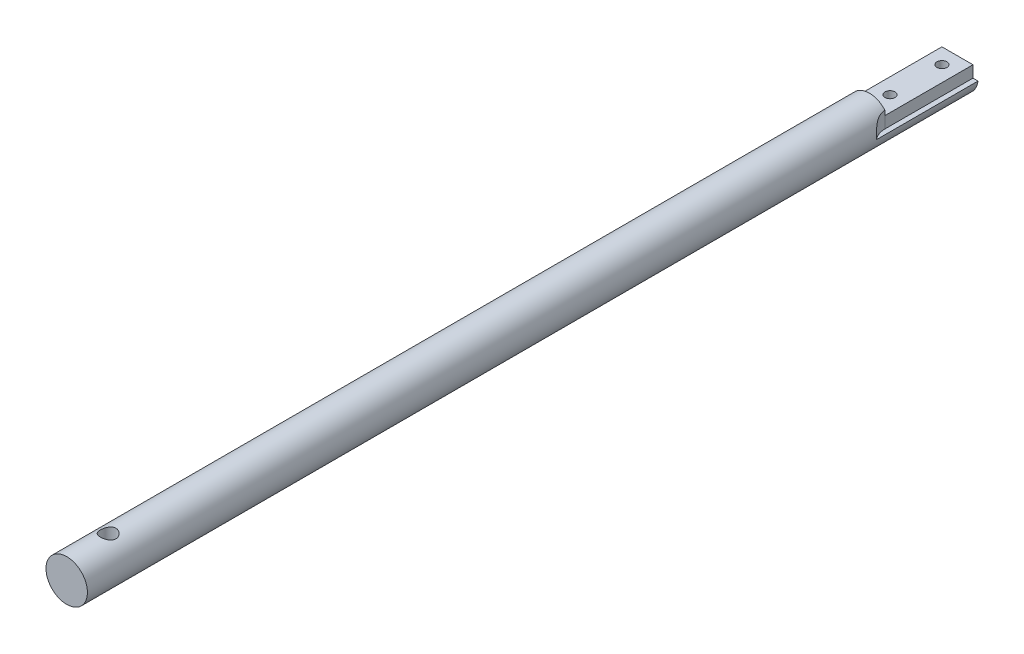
ISO-10303-21;
HEADER;
FILE_DESCRIPTION(('STEP AP214'),'2;1');
FILE_NAME('part.step','',(''),(''),'','','');
FILE_SCHEMA(('AUTOMOTIVE_DESIGN { 1 0 10303 214 1 1 1 1 }'));
ENDSEC;
DATA;
#1=APPLICATION_CONTEXT('core data for automotive mechanical design processes');
#2=APPLICATION_PROTOCOL_DEFINITION('international standard','automotive_design',2000,#1);
#3=PRODUCT_CONTEXT('',#1,'mechanical');
#4=PRODUCT('Part','Part','',(#3));
#5=PRODUCT_RELATED_PRODUCT_CATEGORY('part','',(#4));
#6=PRODUCT_DEFINITION_FORMATION('','',#4);
#7=PRODUCT_DEFINITION_CONTEXT('part definition',#1,'design');
#8=PRODUCT_DEFINITION('design','',#6,#7);
#9=PRODUCT_DEFINITION_SHAPE('','',#8);
#10=(LENGTH_UNIT() NAMED_UNIT(*) SI_UNIT(.MILLI.,.METRE.));
#11=(NAMED_UNIT(*) PLANE_ANGLE_UNIT() SI_UNIT($,.RADIAN.));
#12=(NAMED_UNIT(*) SI_UNIT($,.STERADIAN.) SOLID_ANGLE_UNIT());
#13=UNCERTAINTY_MEASURE_WITH_UNIT(LENGTH_MEASURE(1.E-05),#10,'distance_accuracy_value','');
#14=(GEOMETRIC_REPRESENTATION_CONTEXT(3) GLOBAL_UNCERTAINTY_ASSIGNED_CONTEXT((#13)) GLOBAL_UNIT_ASSIGNED_CONTEXT((#10,
#11,#12)) REPRESENTATION_CONTEXT('',''));
#15=CARTESIAN_POINT('',(0.,0.,0.));
#16=DIRECTION('',(0.,0.,1.));
#17=DIRECTION('',(1.,0.,0.));
#18=AXIS2_PLACEMENT_3D('',#15,#16,#17);
#19=CARTESIAN_POINT('',(0.,0.,136.525));
#20=DIRECTION('',(0.,0.,-1.));
#21=DIRECTION('',(-1.,0.,0.));
#22=AXIS2_PLACEMENT_3D('',#19,#20,#21);
#23=CYLINDRICAL_SURFACE('',#22,3.17500000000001);
#24=CARTESIAN_POINT('',(0.,3.17500000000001,128.98755));
#25=CARTESIAN_POINT('',(-0.0643205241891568,3.17500167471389,128.987547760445));
#26=CARTESIAN_POINT('',(-0.128625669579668,3.173028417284,128.992792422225));
#27=CARTESIAN_POINT('',(-0.255314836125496,3.16535384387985,129.013548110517));
#28=CARTESIAN_POINT('',(-0.317699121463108,3.15965304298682,129.029057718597));
#29=CARTESIAN_POINT('',(-0.43870123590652,3.14513549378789,129.069718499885));
#30=CARTESIAN_POINT('',(-0.497326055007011,3.13632473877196,129.094851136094));
#31=CARTESIAN_POINT('',(-0.609523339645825,3.11646539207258,129.153950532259));
#32=CARTESIAN_POINT('',(-0.663094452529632,3.10541620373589,129.18791964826));
#33=CARTESIAN_POINT('',(-0.765928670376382,3.08169919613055,129.265228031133));
#34=CARTESIAN_POINT('',(-0.814949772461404,3.06898573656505,129.30887507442));
#35=CARTESIAN_POINT('',(-0.905171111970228,3.04359834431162,129.403646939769));
#36=CARTESIAN_POINT('',(-0.946368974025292,3.03092442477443,129.454774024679));
#37=CARTESIAN_POINT('',(-1.02130925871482,3.00652079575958,129.565414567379));
#38=CARTESIAN_POINT('',(-1.05471050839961,2.99484497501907,129.625172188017));
#39=CARTESIAN_POINT('',(-1.11088113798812,2.9744692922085,129.749962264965));
#40=CARTESIAN_POINT('',(-1.13365473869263,2.96576824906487,129.814992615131));
#41=CARTESIAN_POINT('',(-1.16696942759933,2.95281508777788,129.945697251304));
#42=CARTESIAN_POINT('',(-1.17797216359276,2.94839576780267,130.011236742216));
#43=CARTESIAN_POINT('',(-1.18887621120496,2.94401704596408,130.143369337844));
#44=CARTESIAN_POINT('',(-1.18878207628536,2.94405581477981,130.209961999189));
#45=CARTESIAN_POINT('',(-1.17784820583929,2.94844466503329,130.338093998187));
#46=CARTESIAN_POINT('',(-1.16764792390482,2.95253818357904,130.399698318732));
#47=CARTESIAN_POINT('',(-1.13784807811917,2.96414908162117,130.520247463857));
#48=CARTESIAN_POINT('',(-1.11824710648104,2.97166697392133,130.579191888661));
#49=CARTESIAN_POINT('',(-1.06984946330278,2.98943472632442,130.694055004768));
#50=CARTESIAN_POINT('',(-1.04088636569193,2.99973342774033,130.74989568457));
#51=CARTESIAN_POINT('',(-0.974702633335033,3.0218860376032,130.856110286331));
#52=CARTESIAN_POINT('',(-0.937479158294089,3.03374048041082,130.906482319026));
#53=CARTESIAN_POINT('',(-0.852902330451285,3.05863522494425,131.003870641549));
#54=CARTESIAN_POINT('',(-0.805038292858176,3.07170183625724,131.050437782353));
#55=CARTESIAN_POINT('',(-0.702029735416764,3.09686736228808,131.135017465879));
#56=CARTESIAN_POINT('',(-0.646884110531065,3.10896612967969,131.173028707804));
#57=CARTESIAN_POINT('',(-0.529736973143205,3.13107100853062,131.239909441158));
#58=CARTESIAN_POINT('',(-0.467643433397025,3.14104225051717,131.268630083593));
#59=CARTESIAN_POINT('',(-0.339040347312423,3.15751006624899,131.315068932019));
#60=CARTESIAN_POINT('',(-0.272532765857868,3.16400817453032,131.332791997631));
#61=CARTESIAN_POINT('',(-0.140770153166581,3.17252821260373,131.355870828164));
#62=CARTESIAN_POINT('',(-0.0756351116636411,3.17476883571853,131.36183147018));
#63=CARTESIAN_POINT('',(0.0547354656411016,3.1751967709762,131.362976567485));
#64=CARTESIAN_POINT('',(0.119970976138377,3.17338497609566,131.358163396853));
#65=CARTESIAN_POINT('',(0.246081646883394,3.16605593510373,131.338357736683));
#66=CARTESIAN_POINT('',(0.307028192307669,3.16068279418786,131.323760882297));
#67=CARTESIAN_POINT('',(0.425564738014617,3.14691640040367,131.285322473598));
#68=CARTESIAN_POINT('',(0.483154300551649,3.13852275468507,131.261479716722));
#69=CARTESIAN_POINT('',(0.595234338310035,3.11923888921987,131.20446718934));
#70=CARTESIAN_POINT('',(0.649584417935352,3.10828267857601,131.171044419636));
#71=CARTESIAN_POINT('',(0.752086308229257,3.08508628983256,131.09610690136));
#72=CARTESIAN_POINT('',(0.800235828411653,3.0728456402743,131.05458917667));
#73=CARTESIAN_POINT('',(0.891875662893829,3.04755189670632,130.961820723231));
#74=CARTESIAN_POINT('',(0.934936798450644,3.03449267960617,130.910146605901));
#75=CARTESIAN_POINT('',(1.01186048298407,3.00971780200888,130.800048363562));
#76=CARTESIAN_POINT('',(1.04572222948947,2.99800225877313,130.741623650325));
#77=CARTESIAN_POINT('',(1.10331435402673,2.97729202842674,130.61921353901));
#78=CARTESIAN_POINT('',(1.12700411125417,2.9683082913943,130.555207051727));
#79=CARTESIAN_POINT('',(1.16311510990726,2.95434769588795,130.423684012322));
#80=CARTESIAN_POINT('',(1.17554327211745,2.94936837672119,130.356169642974));
#81=CARTESIAN_POINT('',(1.18816166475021,2.94430614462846,130.224194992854));
#82=CARTESIAN_POINT('',(1.18908323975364,2.94393064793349,130.159815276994));
#83=CARTESIAN_POINT('',(1.1805341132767,2.94736917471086,130.031869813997));
#84=CARTESIAN_POINT('',(1.17106438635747,2.95118280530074,129.968303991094));
#85=CARTESIAN_POINT('',(1.14256968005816,2.9623269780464,129.845738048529));
#86=CARTESIAN_POINT('',(1.1238418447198,2.96954785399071,129.786658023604));
#87=CARTESIAN_POINT('',(1.07762368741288,2.98662957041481,129.672443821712));
#88=CARTESIAN_POINT('',(1.05013115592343,2.99649107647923,129.617310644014));
#89=CARTESIAN_POINT('',(0.985497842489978,3.01838358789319,129.509425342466));
#90=CARTESIAN_POINT('',(0.94792821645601,3.03050098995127,129.456947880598));
#91=CARTESIAN_POINT('',(0.864872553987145,3.05524081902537,129.358808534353));
#92=CARTESIAN_POINT('',(0.819384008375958,3.06786340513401,129.313148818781));
#93=CARTESIAN_POINT('',(0.718861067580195,3.09300575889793,129.227441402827));
#94=CARTESIAN_POINT('',(0.663445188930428,3.10548359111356,129.187826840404));
#95=CARTESIAN_POINT('',(0.546305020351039,3.12821550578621,129.118486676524));
#96=CARTESIAN_POINT('',(0.484580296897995,3.13846943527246,129.088761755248));
#97=CARTESIAN_POINT('',(0.35386066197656,3.1559346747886,129.039262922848));
#98=CARTESIAN_POINT('',(0.284671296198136,3.16300376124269,129.019947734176));
#99=CARTESIAN_POINT('',(0.143647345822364,3.17253434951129,128.994095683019));
#100=CARTESIAN_POINT('',(0.0718140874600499,3.17499813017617,128.987552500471));
#101=CARTESIAN_POINT('',(0.,3.17500000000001,128.98755));
#102=B_SPLINE_CURVE_WITH_KNOTS('',3,(#24,#25,#26,#27,#28,#29,#30,#31,#32,#33,#34,#35,#36,#37,
#38,#39,#40,#41,#42,#43,#44,#45,#46,#47,#48,#49,#50,#51,#52,#53,#54,#55,#56,#57,#58,#59,#60,#61,
#62,#63,#64,#65,#66,#67,#68,#69,#70,#71,#72,#73,#74,#75,#76,#77,#78,#79,#80,#81,#82,#83,#84,#85,
#86,#87,#88,#89,#90,#91,#92,#93,#94,#95,#96,#97,#98,#99,#100,#101),.UNSPECIFIED.,.T.,.F.,(4,2,2,
2,2,2,2,2,2,2,2,2,2,2,2,2,2,2,2,2,2,2,2,2,2,2,2,2,2,2,2,2,2,2,2,2,2,2,4),(0.,0.192696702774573,
0.385366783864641,0.577667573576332,0.770019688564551,0.969702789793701,1.1694464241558,
1.37674966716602,1.58397050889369,1.78272732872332,1.98140259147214,2.16826116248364,
2.35514772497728,2.54555824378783,2.73603433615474,2.93923825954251,3.1424730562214,
3.3488189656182,3.5550736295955,3.75041263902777,3.94570860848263,4.13354868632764,
4.32141320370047,4.51478656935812,4.70823116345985,4.91283824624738,5.1174631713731,
5.32289781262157,5.52820611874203,5.72039353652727,5.9125629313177,6.09892997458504,
6.28534403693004,6.48149216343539,6.67770255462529,6.88445138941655,7.0912144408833,
7.306467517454,7.52161405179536),.UNSPECIFIED.);
#103=CARTESIAN_POINT('',(0.,3.17500000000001,128.98755));
#104=VERTEX_POINT('',#103);
#105=EDGE_CURVE('E11',#104,#104,#102,.T.);
#106=ORIENTED_EDGE('',*,*,#105,.F.);
#107=EDGE_LOOP('',(#106));
#108=FACE_BOUND('',#107,.T.);
#109=CARTESIAN_POINT('',(0.,-3.17500000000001,128.98755));
#110=CARTESIAN_POINT('',(0.0643205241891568,-3.17500167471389,128.987547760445));
#111=CARTESIAN_POINT('',(0.128625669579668,-3.173028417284,128.992792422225));
#112=CARTESIAN_POINT('',(0.255314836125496,-3.16535384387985,129.013548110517));
#113=CARTESIAN_POINT('',(0.317699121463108,-3.15965304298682,129.029057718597));
#114=CARTESIAN_POINT('',(0.43870123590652,-3.14513549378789,129.069718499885));
#115=CARTESIAN_POINT('',(0.497326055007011,-3.13632473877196,129.094851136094));
#116=CARTESIAN_POINT('',(0.609523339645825,-3.11646539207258,129.153950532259));
#117=CARTESIAN_POINT('',(0.663094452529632,-3.10541620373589,129.18791964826));
#118=CARTESIAN_POINT('',(0.765928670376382,-3.08169919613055,129.265228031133));
#119=CARTESIAN_POINT('',(0.814949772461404,-3.06898573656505,129.30887507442));
#120=CARTESIAN_POINT('',(0.905171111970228,-3.04359834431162,129.403646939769));
#121=CARTESIAN_POINT('',(0.946368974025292,-3.03092442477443,129.454774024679));
#122=CARTESIAN_POINT('',(1.02130925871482,-3.00652079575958,129.565414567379));
#123=CARTESIAN_POINT('',(1.05471050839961,-2.99484497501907,129.625172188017));
#124=CARTESIAN_POINT('',(1.11088113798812,-2.9744692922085,129.749962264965));
#125=CARTESIAN_POINT('',(1.13365473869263,-2.96576824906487,129.814992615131));
#126=CARTESIAN_POINT('',(1.16696942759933,-2.95281508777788,129.945697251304));
#127=CARTESIAN_POINT('',(1.17797216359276,-2.94839576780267,130.011236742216));
#128=CARTESIAN_POINT('',(1.18887621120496,-2.94401704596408,130.143369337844));
#129=CARTESIAN_POINT('',(1.18878207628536,-2.94405581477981,130.209961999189));
#130=CARTESIAN_POINT('',(1.17784820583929,-2.94844466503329,130.338093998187));
#131=CARTESIAN_POINT('',(1.16764792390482,-2.95253818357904,130.399698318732));
#132=CARTESIAN_POINT('',(1.13784807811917,-2.96414908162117,130.520247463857));
#133=CARTESIAN_POINT('',(1.11824710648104,-2.97166697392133,130.579191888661));
#134=CARTESIAN_POINT('',(1.06984946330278,-2.98943472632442,130.694055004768));
#135=CARTESIAN_POINT('',(1.04088636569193,-2.99973342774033,130.74989568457));
#136=CARTESIAN_POINT('',(0.974702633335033,-3.0218860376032,130.856110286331));
#137=CARTESIAN_POINT('',(0.937479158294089,-3.03374048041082,130.906482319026));
#138=CARTESIAN_POINT('',(0.852902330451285,-3.05863522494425,131.003870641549));
#139=CARTESIAN_POINT('',(0.805038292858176,-3.07170183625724,131.050437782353));
#140=CARTESIAN_POINT('',(0.702029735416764,-3.09686736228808,131.135017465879));
#141=CARTESIAN_POINT('',(0.646884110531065,-3.10896612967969,131.173028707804));
#142=CARTESIAN_POINT('',(0.529736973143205,-3.13107100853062,131.239909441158));
#143=CARTESIAN_POINT('',(0.467643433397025,-3.14104225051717,131.268630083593));
#144=CARTESIAN_POINT('',(0.339040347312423,-3.15751006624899,131.315068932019));
#145=CARTESIAN_POINT('',(0.272532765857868,-3.16400817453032,131.332791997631));
#146=CARTESIAN_POINT('',(0.140770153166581,-3.17252821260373,131.355870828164));
#147=CARTESIAN_POINT('',(0.0756351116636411,-3.17476883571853,131.36183147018));
#148=CARTESIAN_POINT('',(-0.0547354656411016,-3.1751967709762,131.362976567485));
#149=CARTESIAN_POINT('',(-0.119970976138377,-3.17338497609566,131.358163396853));
#150=CARTESIAN_POINT('',(-0.246081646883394,-3.16605593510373,131.338357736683));
#151=CARTESIAN_POINT('',(-0.307028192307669,-3.16068279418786,131.323760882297));
#152=CARTESIAN_POINT('',(-0.425564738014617,-3.14691640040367,131.285322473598));
#153=CARTESIAN_POINT('',(-0.483154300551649,-3.13852275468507,131.261479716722));
#154=CARTESIAN_POINT('',(-0.595234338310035,-3.11923888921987,131.20446718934));
#155=CARTESIAN_POINT('',(-0.649584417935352,-3.10828267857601,131.171044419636));
#156=CARTESIAN_POINT('',(-0.752086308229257,-3.08508628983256,131.09610690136));
#157=CARTESIAN_POINT('',(-0.800235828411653,-3.0728456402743,131.05458917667));
#158=CARTESIAN_POINT('',(-0.891875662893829,-3.04755189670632,130.961820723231));
#159=CARTESIAN_POINT('',(-0.934936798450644,-3.03449267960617,130.910146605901));
#160=CARTESIAN_POINT('',(-1.01186048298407,-3.00971780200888,130.800048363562));
#161=CARTESIAN_POINT('',(-1.04572222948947,-2.99800225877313,130.741623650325));
#162=CARTESIAN_POINT('',(-1.10331435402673,-2.97729202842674,130.61921353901));
#163=CARTESIAN_POINT('',(-1.12700411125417,-2.9683082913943,130.555207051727));
#164=CARTESIAN_POINT('',(-1.16311510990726,-2.95434769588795,130.423684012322));
#165=CARTESIAN_POINT('',(-1.17554327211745,-2.94936837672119,130.356169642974));
#166=CARTESIAN_POINT('',(-1.18816166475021,-2.94430614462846,130.224194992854));
#167=CARTESIAN_POINT('',(-1.18908323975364,-2.94393064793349,130.159815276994));
#168=CARTESIAN_POINT('',(-1.1805341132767,-2.94736917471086,130.031869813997));
#169=CARTESIAN_POINT('',(-1.17106438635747,-2.95118280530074,129.968303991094));
#170=CARTESIAN_POINT('',(-1.14256968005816,-2.9623269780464,129.845738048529));
#171=CARTESIAN_POINT('',(-1.1238418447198,-2.96954785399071,129.786658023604));
#172=CARTESIAN_POINT('',(-1.07762368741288,-2.98662957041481,129.672443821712));
#173=CARTESIAN_POINT('',(-1.05013115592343,-2.99649107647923,129.617310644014));
#174=CARTESIAN_POINT('',(-0.985497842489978,-3.01838358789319,129.509425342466));
#175=CARTESIAN_POINT('',(-0.94792821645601,-3.03050098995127,129.456947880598));
#176=CARTESIAN_POINT('',(-0.864872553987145,-3.05524081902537,129.358808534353));
#177=CARTESIAN_POINT('',(-0.819384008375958,-3.06786340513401,129.313148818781));
#178=CARTESIAN_POINT('',(-0.718861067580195,-3.09300575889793,129.227441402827));
#179=CARTESIAN_POINT('',(-0.663445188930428,-3.10548359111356,129.187826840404));
#180=CARTESIAN_POINT('',(-0.546305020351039,-3.12821550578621,129.118486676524));
#181=CARTESIAN_POINT('',(-0.484580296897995,-3.13846943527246,129.088761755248));
#182=CARTESIAN_POINT('',(-0.35386066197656,-3.1559346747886,129.039262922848));
#183=CARTESIAN_POINT('',(-0.284671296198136,-3.16300376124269,129.019947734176));
#184=CARTESIAN_POINT('',(-0.143647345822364,-3.17253434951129,128.994095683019));
#185=CARTESIAN_POINT('',(-0.0718140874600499,-3.17499813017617,128.987552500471));
#186=CARTESIAN_POINT('',(0.,-3.17500000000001,128.98755));
#187=B_SPLINE_CURVE_WITH_KNOTS('',3,(#109,#110,#111,#112,#113,#114,#115,#116,#117,#118,#119,
#120,#121,#122,#123,#124,#125,#126,#127,#128,#129,#130,#131,#132,#133,#134,#135,#136,#137,#138,
#139,#140,#141,#142,#143,#144,#145,#146,#147,#148,#149,#150,#151,#152,#153,#154,#155,#156,#157,
#158,#159,#160,#161,#162,#163,#164,#165,#166,#167,#168,#169,#170,#171,#172,#173,#174,#175,#176,
#177,#178,#179,#180,#181,#182,#183,#184,#185,#186),.UNSPECIFIED.,.T.,.F.,(4,2,2,2,2,2,2,2,2,2,2,
2,2,2,2,2,2,2,2,2,2,2,2,2,2,2,2,2,2,2,2,2,2,2,2,2,2,2,4),(0.,0.192696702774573,
0.385366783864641,0.577667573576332,0.770019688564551,0.969702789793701,1.1694464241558,
1.37674966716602,1.58397050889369,1.78272732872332,1.98140259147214,2.16826116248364,
2.35514772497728,2.54555824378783,2.73603433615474,2.93923825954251,3.1424730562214,
3.3488189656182,3.5550736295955,3.75041263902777,3.94570860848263,4.13354868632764,
4.32141320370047,4.51478656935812,4.70823116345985,4.91283824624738,5.1174631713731,
5.32289781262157,5.52820611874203,5.72039353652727,5.9125629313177,6.09892997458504,
6.28534403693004,6.48149216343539,6.67770255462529,6.88445138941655,7.0912144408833,
7.306467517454,7.52161405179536),.UNSPECIFIED.);
#188=CARTESIAN_POINT('',(0.,-3.17500000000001,128.98755));
#189=VERTEX_POINT('',#188);
#190=EDGE_CURVE('E222',#189,#189,#187,.T.);
#191=ORIENTED_EDGE('',*,*,#190,.F.);
#192=EDGE_LOOP('',(#191));
#193=FACE_BOUND('',#192,.T.);
#194=CARTESIAN_POINT('',(0.,-3.17500000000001,9.57580866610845));
#195=CARTESIAN_POINT('',(0.0421595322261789,-3.17499925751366,9.57601101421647));
#196=CARTESIAN_POINT('',(0.0843169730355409,-3.17415185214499,9.57972157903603));
#197=CARTESIAN_POINT('',(0.167393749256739,-3.17085734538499,9.59404425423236));
#198=CARTESIAN_POINT('',(0.20831230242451,-3.16840925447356,9.60466063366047));
#199=CARTESIAN_POINT('',(0.287700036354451,-3.16218880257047,9.632438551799));
#200=CARTESIAN_POINT('',(0.326171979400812,-3.15841796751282,9.64959255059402));
#201=CARTESIAN_POINT('',(0.399692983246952,-3.14995900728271,9.68993424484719));
#202=CARTESIAN_POINT('',(0.434741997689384,-3.14527086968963,9.7131220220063));
#203=CARTESIAN_POINT('',(0.501090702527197,-3.13539131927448,9.76534097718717));
#204=CARTESIAN_POINT('',(0.532315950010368,-3.13019266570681,9.79446537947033));
#205=CARTESIAN_POINT('',(0.589487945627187,-3.11993181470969,9.85752729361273));
#206=CARTESIAN_POINT('',(0.615434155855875,-3.11486963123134,9.89146529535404));
#207=CARTESIAN_POINT('',(0.661640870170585,-3.10538595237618,9.96374546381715));
#208=CARTESIAN_POINT('',(0.681821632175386,-3.10097381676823,10.0021399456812));
#209=CARTESIAN_POINT('',(0.715414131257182,-3.09339719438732,10.0818991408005));
#210=CARTESIAN_POINT('',(0.728826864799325,-3.09023252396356,10.1232634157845));
#211=CARTESIAN_POINT('',(0.748256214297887,-3.0855852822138,10.2069706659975));
#212=CARTESIAN_POINT('',(0.754406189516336,-3.08407242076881,10.2492809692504));
#213=CARTESIAN_POINT('',(0.75954839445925,-3.08281022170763,10.3343575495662));
#214=CARTESIAN_POINT('',(0.758541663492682,-3.08306062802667,10.377123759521));
#215=CARTESIAN_POINT('',(0.749508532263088,-3.08526853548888,10.4609159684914));
#216=CARTESIAN_POINT('',(0.741635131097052,-3.08718882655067,10.5019595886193));
#217=CARTESIAN_POINT('',(0.719331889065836,-3.0924612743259,10.5821266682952));
#218=CARTESIAN_POINT('',(0.704901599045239,-3.09581352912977,10.6212499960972));
#219=CARTESIAN_POINT('',(0.669747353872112,-3.10360904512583,10.6969080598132));
#220=CARTESIAN_POINT('',(0.648963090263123,-3.10806267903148,10.7334136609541));
#221=CARTESIAN_POINT('',(0.601734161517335,-3.11755025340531,10.8024762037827));
#222=CARTESIAN_POINT('',(0.575288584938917,-3.12258428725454,10.8350325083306));
#223=CARTESIAN_POINT('',(0.516675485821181,-3.13282256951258,10.8961551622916));
#224=CARTESIAN_POINT('',(0.484377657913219,-3.13802785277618,10.9245965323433));
#225=CARTESIAN_POINT('',(0.415405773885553,-3.14790006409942,10.9756802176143));
#226=CARTESIAN_POINT('',(0.378731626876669,-3.15256698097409,10.9983224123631));
#227=CARTESIAN_POINT('',(0.301906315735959,-3.16084984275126,11.0371897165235));
#228=CARTESIAN_POINT('',(0.261747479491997,-3.1644633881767,11.053400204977));
#229=CARTESIAN_POINT('',(0.179169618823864,-3.17021040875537,11.0788074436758));
#230=CARTESIAN_POINT('',(0.13675099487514,-3.17234414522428,11.0880054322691));
#231=CARTESIAN_POINT('',(0.0519409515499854,-3.17485180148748,11.0989438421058));
#232=CARTESIAN_POINT('',(0.00957292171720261,-3.17526640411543,11.1008565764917));
#233=CARTESIAN_POINT('',(-0.074874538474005,-3.17439781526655,11.0976380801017));
#234=CARTESIAN_POINT('',(-0.11695399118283,-3.17311475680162,11.0925074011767));
#235=CARTESIAN_POINT('',(-0.199073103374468,-3.16901636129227,11.0754880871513));
#236=CARTESIAN_POINT('',(-0.239132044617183,-3.16622095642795,11.0636872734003));
#237=CARTESIAN_POINT('',(-0.316700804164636,-3.1594054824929,11.0337611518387));
#238=CARTESIAN_POINT('',(-0.354210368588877,-3.15538529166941,11.0156352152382));
#239=CARTESIAN_POINT('',(-0.426327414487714,-3.14646056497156,10.9732167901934));
#240=CARTESIAN_POINT('',(-0.460873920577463,-3.14154201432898,10.9488236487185));
#241=CARTESIAN_POINT('',(-0.52544420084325,-3.13139004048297,10.8946964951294));
#242=CARTESIAN_POINT('',(-0.555467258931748,-3.12615656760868,10.8649616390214));
#243=CARTESIAN_POINT('',(-0.6108256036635,-3.1158191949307,10.8002033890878));
#244=CARTESIAN_POINT('',(-0.63604152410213,-3.11072078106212,10.7650769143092));
#245=CARTESIAN_POINT('',(-0.680216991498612,-3.10136127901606,10.690984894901));
#246=CARTESIAN_POINT('',(-0.699176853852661,-3.0971001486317,10.6520195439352));
#247=CARTESIAN_POINT('',(-0.730150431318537,-3.08994466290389,10.571599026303));
#248=CARTESIAN_POINT('',(-0.742209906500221,-3.08704132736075,10.5301623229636));
#249=CARTESIAN_POINT('',(-0.759172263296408,-3.08291423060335,10.4457704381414));
#250=CARTESIAN_POINT('',(-0.764076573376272,-3.08169013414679,10.4028155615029));
#251=CARTESIAN_POINT('',(-0.766526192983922,-3.08108157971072,10.3178335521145));
#252=CARTESIAN_POINT('',(-0.764264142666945,-3.08164896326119,10.2758122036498));
#253=CARTESIAN_POINT('',(-0.752878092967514,-3.0844502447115,10.1927691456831));
#254=CARTESIAN_POINT('',(-0.743754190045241,-3.08668411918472,10.1517474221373));
#255=CARTESIAN_POINT('',(-0.718999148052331,-3.09254339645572,10.072034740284));
#256=CARTESIAN_POINT('',(-0.703397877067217,-3.09616240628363,10.0333340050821));
#257=CARTESIAN_POINT('',(-0.666155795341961,-3.10438779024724,9.95907159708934));
#258=CARTESIAN_POINT('',(-0.644514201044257,-3.10899429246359,9.92351033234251));
#259=CARTESIAN_POINT('',(-0.595180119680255,-3.1188189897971,9.85559473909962));
#260=CARTESIAN_POINT('',(-0.56735205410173,-3.12404943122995,9.82334064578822));
#261=CARTESIAN_POINT('',(-0.50670845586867,-3.13445630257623,9.7638980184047));
#262=CARTESIAN_POINT('',(-0.473891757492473,-3.13963271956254,9.73671067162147));
#263=CARTESIAN_POINT('',(-0.403561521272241,-3.14945115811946,9.68774801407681));
#264=CARTESIAN_POINT('',(-0.365980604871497,-3.15408318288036,9.66606734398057));
#265=CARTESIAN_POINT('',(-0.287600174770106,-3.16219199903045,9.62936737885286));
#266=CARTESIAN_POINT('',(-0.246803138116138,-3.16566966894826,9.61434301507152));
#267=CARTESIAN_POINT('',(-0.171689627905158,-3.17053067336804,9.59376001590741));
#268=CARTESIAN_POINT('',(-0.137742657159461,-3.1721961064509,9.58689769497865));
#269=CARTESIAN_POINT('',(-0.0691966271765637,-3.17443103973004,9.57783914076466));
#270=CARTESIAN_POINT('',(-0.0345976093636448,-3.17500060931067,9.57564261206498));
#271=CARTESIAN_POINT('',(0.,-3.17500000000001,9.57580866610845));
#272=B_SPLINE_CURVE_WITH_KNOTS('',3,(#194,#195,#196,#197,#198,#199,#200,#201,#202,#203,#204,
#205,#206,#207,#208,#209,#210,#211,#212,#213,#214,#215,#216,#217,#218,#219,#220,#221,#222,#223,
#224,#225,#226,#227,#228,#229,#230,#231,#232,#233,#234,#235,#236,#237,#238,#239,#240,#241,#242,
#243,#244,#245,#246,#247,#248,#249,#250,#251,#252,#253,#254,#255,#256,#257,#258,#259,#260,#261,
#262,#263,#264,#265,#266,#267,#268,#269,#270,#271),.UNSPECIFIED.,.T.,.F.,(4,2,2,2,2,2,2,2,2,2,2,
2,2,2,2,2,2,2,2,2,2,2,2,2,2,2,2,2,2,2,2,2,2,2,2,2,2,2,4),(0.,0.126353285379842,
0.252784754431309,0.379070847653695,0.505358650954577,0.633808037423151,0.762270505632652,
0.892432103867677,1.02257453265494,1.15028816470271,1.2779832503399,1.40290376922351,
1.52783284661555,1.65398657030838,1.78016061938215,1.90959813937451,2.03903834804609,
2.16877114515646,2.29848102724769,2.42510320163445,2.55171545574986,2.67669827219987,
2.80169351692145,2.92883756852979,3.0560017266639,3.18599950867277,3.3159907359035,
3.44510962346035,3.57420273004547,3.69985539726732,3.8255062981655,3.95058412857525,
4.07567819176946,4.2038451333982,4.33204207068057,4.4623123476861,4.5924832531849,
4.69617981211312,4.79986980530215),.UNSPECIFIED.);
#273=CARTESIAN_POINT('',(0.,-3.17500000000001,9.57580866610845));
#274=VERTEX_POINT('',#273);
#275=EDGE_CURVE('E44',#274,#274,#272,.T.);
#276=ORIENTED_EDGE('',*,*,#275,.F.);
#277=EDGE_LOOP('',(#276));
#278=FACE_BOUND('',#277,.T.);
#279=CARTESIAN_POINT('',(0.,-3.17500000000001,1.60036599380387));
#280=CARTESIAN_POINT('',(0.0421684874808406,-3.17499926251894,1.60124759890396));
#281=CARTESIAN_POINT('',(0.084278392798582,-3.17415150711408,1.60563987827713));
#282=CARTESIAN_POINT('',(0.167148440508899,-3.1708689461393,1.62131106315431));
#283=CARTESIAN_POINT('',(0.207907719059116,-3.16843314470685,1.63259428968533));
#284=CARTESIAN_POINT('',(0.286870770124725,-3.16226146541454,1.6616721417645));
#285=CARTESIAN_POINT('',(0.325077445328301,-3.158527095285,1.6794592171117));
#286=CARTESIAN_POINT('',(0.397969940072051,-3.15017344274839,1.72101917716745));
#287=CARTESIAN_POINT('',(0.432655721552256,-3.14555415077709,1.74479212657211));
#288=CARTESIAN_POINT('',(0.498179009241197,-3.13585071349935,1.79812816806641));
#289=CARTESIAN_POINT('',(0.52894081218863,-3.13075998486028,1.82778307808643));
#290=CARTESIAN_POINT('',(0.585101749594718,-3.12075256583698,1.89182784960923));
#291=CARTESIAN_POINT('',(0.610500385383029,-3.11583589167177,1.92621815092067));
#292=CARTESIAN_POINT('',(0.655504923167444,-3.10668214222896,1.99927304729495));
#293=CARTESIAN_POINT('',(0.675037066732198,-3.10245400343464,2.03798429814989));
#294=CARTESIAN_POINT('',(0.707287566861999,-3.0952615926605,2.11825801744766));
#295=CARTESIAN_POINT('',(0.720006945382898,-3.0922971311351,2.15982005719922));
#296=CARTESIAN_POINT('',(0.738037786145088,-3.08804311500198,2.24377831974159));
#297=CARTESIAN_POINT('',(0.74348519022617,-3.08672285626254,2.28614376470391));
#298=CARTESIAN_POINT('',(0.747230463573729,-3.08581850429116,2.37120513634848));
#299=CARTESIAN_POINT('',(0.745529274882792,-3.08623418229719,2.41390101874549));
#300=CARTESIAN_POINT('',(0.735145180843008,-3.08872356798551,2.4975061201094));
#301=CARTESIAN_POINT('',(0.726603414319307,-3.09076375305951,2.53843400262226));
#302=CARTESIAN_POINT('',(0.702989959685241,-3.09621958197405,2.6182624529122));
#303=CARTESIAN_POINT('',(0.687917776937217,-3.09963533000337,2.65716286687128));
#304=CARTESIAN_POINT('',(0.651490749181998,-3.10749643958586,2.7323234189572));
#305=CARTESIAN_POINT('',(0.630068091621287,-3.11195279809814,2.76854949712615));
#306=CARTESIAN_POINT('',(0.581601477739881,-3.12137350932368,2.83695095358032));
#307=CARTESIAN_POINT('',(0.554556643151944,-3.12633794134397,2.86912569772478));
#308=CARTESIAN_POINT('',(0.494819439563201,-3.13635399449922,2.9293398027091));
#309=CARTESIAN_POINT('',(0.462004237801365,-3.14140474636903,2.95725760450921));
#310=CARTESIAN_POINT('',(0.392083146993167,-3.15089489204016,3.00720863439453));
#311=CARTESIAN_POINT('',(0.354977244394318,-3.15533428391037,3.02924184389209));
#312=CARTESIAN_POINT('',(0.277483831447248,-3.1630905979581,3.06677099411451));
#313=CARTESIAN_POINT('',(0.237096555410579,-3.1664076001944,3.08226740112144));
#314=CARTESIAN_POINT('',(0.154195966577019,-3.17152504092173,3.10622324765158));
#315=CARTESIAN_POINT('',(0.111683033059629,-3.17332574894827,3.11468393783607));
#316=CARTESIAN_POINT('',(0.0268357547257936,-3.17516333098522,3.12416832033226));
#317=CARTESIAN_POINT('',(-0.0154783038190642,-3.17524157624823,3.12536594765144));
#318=CARTESIAN_POINT('',(-0.0996892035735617,-3.17371396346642,3.1207525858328));
#319=CARTESIAN_POINT('',(-0.141586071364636,-3.17210821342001,3.11494204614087));
#320=CARTESIAN_POINT('',(-0.223320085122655,-3.1673983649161,3.09661033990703));
#321=CARTESIAN_POINT('',(-0.263174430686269,-3.16431042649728,3.08416139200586));
#322=CARTESIAN_POINT('',(-0.340229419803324,-3.15695556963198,3.05298589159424));
#323=CARTESIAN_POINT('',(-0.377429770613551,-3.15268852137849,3.03425864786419));
#324=CARTESIAN_POINT('',(-0.448897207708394,-3.14331689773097,2.99064786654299));
#325=CARTESIAN_POINT('',(-0.483095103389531,-3.13819794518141,2.96565408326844));
#326=CARTESIAN_POINT('',(-0.546871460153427,-3.12771530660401,2.9103781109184));
#327=CARTESIAN_POINT('',(-0.576449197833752,-3.12235158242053,2.88009509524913));
#328=CARTESIAN_POINT('',(-0.630794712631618,-3.11183341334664,2.81431968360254));
#329=CARTESIAN_POINT('',(-0.655445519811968,-3.10668593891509,2.77872935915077));
#330=CARTESIAN_POINT('',(-0.698413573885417,-3.09730999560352,2.70379894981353));
#331=CARTESIAN_POINT('',(-0.716731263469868,-3.09308146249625,2.66445912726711));
#332=CARTESIAN_POINT('',(-0.746322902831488,-3.0860748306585,2.58349825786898));
#333=CARTESIAN_POINT('',(-0.757659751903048,-3.08328381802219,2.54190137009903));
#334=CARTESIAN_POINT('',(-0.773165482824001,-3.07943263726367,2.4573170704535));
#335=CARTESIAN_POINT('',(-0.777335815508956,-3.07837211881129,2.41432994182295));
#336=CARTESIAN_POINT('',(-0.778350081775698,-3.07811563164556,2.32944505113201));
#337=CARTESIAN_POINT('',(-0.775391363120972,-3.07886943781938,2.28754966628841));
#338=CARTESIAN_POINT('',(-0.762658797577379,-3.08204784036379,2.20487531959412));
#339=CARTESIAN_POINT('',(-0.752884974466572,-3.08447243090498,2.16409635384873));
#340=CARTESIAN_POINT('',(-0.72687680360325,-3.09070409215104,2.08490102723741));
#341=CARTESIAN_POINT('',(-0.710660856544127,-3.09450722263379,2.04647829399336));
#342=CARTESIAN_POINT('',(-0.672248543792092,-3.10307791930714,1.9728666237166));
#343=CARTESIAN_POINT('',(-0.650051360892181,-3.1078456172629,1.93767812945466));
#344=CARTESIAN_POINT('',(-0.599628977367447,-3.11797154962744,1.87055288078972));
#345=CARTESIAN_POINT('',(-0.571262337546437,-3.12334189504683,1.83872416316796));
#346=CARTESIAN_POINT('',(-0.509611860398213,-3.1339906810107,1.78021783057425));
#347=CARTESIAN_POINT('',(-0.47632688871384,-3.13926910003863,1.75354140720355));
#348=CARTESIAN_POINT('',(-0.405156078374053,-3.14925123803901,1.70569854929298));
#349=CARTESIAN_POINT('',(-0.367206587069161,-3.15394471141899,1.68462452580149));
#350=CARTESIAN_POINT('',(-0.2881914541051,-3.16214216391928,1.64919565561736));
#351=CARTESIAN_POINT('',(-0.247128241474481,-3.16564705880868,1.6348356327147));
#352=CARTESIAN_POINT('',(-0.17170892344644,-3.17053067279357,1.61550088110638));
#353=CARTESIAN_POINT('',(-0.137703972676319,-3.17219799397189,1.60920549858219));
#354=CARTESIAN_POINT('',(-0.0691195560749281,-3.17443292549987,1.60127713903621));
#355=CARTESIAN_POINT('',(-0.0345401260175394,-3.17500060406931,1.59964387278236));
#356=CARTESIAN_POINT('',(0.,-3.17500000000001,1.60036599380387));
#357=B_SPLINE_CURVE_WITH_KNOTS('',3,(#279,#280,#281,#282,#283,#284,#285,#286,#287,#288,#289,
#290,#291,#292,#293,#294,#295,#296,#297,#298,#299,#300,#301,#302,#303,#304,#305,#306,#307,#308,
#309,#310,#311,#312,#313,#314,#315,#316,#317,#318,#319,#320,#321,#322,#323,#324,#325,#326,#327,
#328,#329,#330,#331,#332,#333,#334,#335,#336,#337,#338,#339,#340,#341,#342,#343,#344,#345,#346,
#347,#348,#349,#350,#351,#352,#353,#354,#355,#356),.UNSPECIFIED.,.T.,.F.,(4,2,2,2,2,2,2,2,2,2,2,
2,2,2,2,2,2,2,2,2,2,2,2,2,2,2,2,2,2,2,2,2,2,2,2,2,2,2,4),(0.,0.126406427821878,
0.252892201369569,0.379231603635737,0.505572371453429,0.634067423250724,0.762574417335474,
0.892635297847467,1.022676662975,1.15025131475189,1.27780915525,1.40280092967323,
1.52780217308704,1.65418950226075,1.78059658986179,1.91012119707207,2.0396462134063,
2.1691619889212,2.29865473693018,2.42503375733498,2.55140467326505,2.67642804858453,
2.80146519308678,2.92887888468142,3.05631250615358,3.18648350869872,3.31664541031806,
3.44561666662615,3.57456181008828,3.6999786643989,3.82539508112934,3.9504558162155,
4.07553364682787,4.20385621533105,4.33220842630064,4.46256218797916,4.59281528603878,
4.69636096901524,4.79990022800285),.UNSPECIFIED.);
#358=CARTESIAN_POINT('',(0.,-3.17500000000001,1.60036599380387));
#359=VERTEX_POINT('',#358);
#360=EDGE_CURVE('E229',#359,#359,#357,.T.);
#361=ORIENTED_EDGE('',*,*,#360,.F.);
#362=EDGE_LOOP('',(#361));
#363=FACE_BOUND('',#362,.T.);
#364=CARTESIAN_POINT('',(0.,0.,136.525));
#365=DIRECTION('',(0.,0.,-1.));
#366=DIRECTION('',(-1.,0.,0.));
#367=AXIS2_PLACEMENT_3D('',#364,#365,#366);
#368=CIRCLE('',#367,3.17500000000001);
#369=CARTESIAN_POINT('',(-3.17500000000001,0.,136.525));
#370=VERTEX_POINT('',#369);
#371=EDGE_CURVE('E158',#370,#370,#368,.T.);
#372=ORIENTED_EDGE('',*,*,#371,.T.);
#373=EDGE_LOOP('',(#372));
#374=FACE_BOUND('',#373,.T.);
#375=CARTESIAN_POINT('',(0.,0.,13.49375));
#376=DIRECTION('',(0.,0.,1.));
#377=DIRECTION('',(1.,0.,0.));
#378=AXIS2_PLACEMENT_3D('',#375,#376,#377);
#379=CIRCLE('',#378,3.17500000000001);
#380=CARTESIAN_POINT('',(-2.38125,2.10006510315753,13.49375));
#381=VERTEX_POINT('',#380);
#382=CARTESIAN_POINT('',(2.38125,2.10006510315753,13.49375));
#383=VERTEX_POINT('',#382);
#384=EDGE_CURVE('E163',#381,#383,#379,.F.);
#385=ORIENTED_EDGE('',*,*,#384,.F.);
#386=DIRECTION('',(0.,0.,-1.));
#387=VECTOR('',#386,1.);
#388=CARTESIAN_POINT('',(-2.38125,2.10006510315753,136.525));
#389=LINE('',#388,#387);
#390=CARTESIAN_POINT('',(-2.38125,2.10006510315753,13.493877));
#391=VERTEX_POINT('',#390);
#392=EDGE_CURVE('E124',#381,#391,#389,.F.);
#393=ORIENTED_EDGE('',*,*,#392,.T.);
#394=CARTESIAN_POINT('',(-3.17500000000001,0.,15.5939421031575));
#395=CARTESIAN_POINT('',(-3.17499373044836,-0.114105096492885,15.5939432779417));
#396=CARTESIAN_POINT('',(-3.16880431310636,-0.228314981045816,15.5869810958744));
#397=CARTESIAN_POINT('',(-3.14445190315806,-0.453811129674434,15.5588685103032));
#398=CARTESIAN_POINT('',(-3.12627048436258,-0.565092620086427,15.5376962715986));
#399=CARTESIAN_POINT('',(-3.07928517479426,-0.781599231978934,15.4804916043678));
#400=CARTESIAN_POINT('',(-3.05046985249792,-0.886817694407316,15.4444431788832));
#401=CARTESIAN_POINT('',(-2.98470907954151,-1.08780005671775,15.3568801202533));
#402=CARTESIAN_POINT('',(-2.94776944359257,-1.18357064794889,15.3053765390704));
#403=CARTESIAN_POINT('',(-2.87006273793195,-1.36109667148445,15.1879438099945));
#404=CARTESIAN_POINT('',(-2.82938319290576,-1.44308671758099,15.1223119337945));
#405=CARTESIAN_POINT('',(-2.74766913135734,-1.59319182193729,14.9769238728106));
#406=CARTESIAN_POINT('',(-2.7066346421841,-1.66130793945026,14.8971687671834));
#407=CARTESIAN_POINT('',(-2.62962545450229,-1.78061484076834,14.7283044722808));
#408=CARTESIAN_POINT('',(-2.59352800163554,-1.83229246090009,14.639593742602));
#409=CARTESIAN_POINT('',(-2.52801303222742,-1.92168109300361,14.4531330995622));
#410=CARTESIAN_POINT('',(-2.49859687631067,-1.95938926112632,14.3553813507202));
#411=CARTESIAN_POINT('',(-2.44817130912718,-2.02206600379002,14.1510094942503));
#412=CARTESIAN_POINT('',(-2.42738954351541,-2.04669386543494,14.0442291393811));
#413=CARTESIAN_POINT('',(-2.3968532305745,-2.08237160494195,13.8268826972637));
#414=CARTESIAN_POINT('',(-2.38710192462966,-2.09341749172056,13.7163155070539));
#415=CARTESIAN_POINT('',(-2.37912529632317,-2.10248275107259,13.4890347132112));
#416=CARTESIAN_POINT('',(-2.38146023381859,-2.09986887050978,13.3722754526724));
#417=CARTESIAN_POINT('',(-2.3987959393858,-2.08004152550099,13.1409386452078));
#418=CARTESIAN_POINT('',(-2.41379819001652,-2.06282635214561,13.026361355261));
#419=CARTESIAN_POINT('',(-2.4555228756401,-2.01298183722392,12.801557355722));
#420=CARTESIAN_POINT('',(-2.48236070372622,-1.98020048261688,12.6913854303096));
#421=CARTESIAN_POINT('',(-2.54542460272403,-1.89844295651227,12.4801232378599));
#422=CARTESIAN_POINT('',(-2.58164651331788,-1.8494739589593,12.3790289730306));
#423=CARTESIAN_POINT('',(-2.65837265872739,-1.73726664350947,12.1928435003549));
#424=CARTESIAN_POINT('',(-2.69865613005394,-1.67465589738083,12.1072834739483));
#425=CARTESIAN_POINT('',(-2.78055309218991,-1.53482479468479,11.9498502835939));
#426=CARTESIAN_POINT('',(-2.82216623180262,-1.45760826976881,11.8779735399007));
#427=CARTESIAN_POINT('',(-2.90092371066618,-1.29352877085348,11.7516908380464));
#428=CARTESIAN_POINT('',(-2.93817863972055,-1.20715439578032,11.6967166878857));
#429=CARTESIAN_POINT('',(-3.0066570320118,-1.02475707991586,11.600814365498));
#430=CARTESIAN_POINT('',(-3.03787928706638,-0.928732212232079,11.5598890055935));
#431=CARTESIAN_POINT('',(-3.09222873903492,-0.727854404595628,11.4910806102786));
#432=CARTESIAN_POINT('',(-3.11519555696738,-0.622871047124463,11.4634527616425));
#433=CARTESIAN_POINT('',(-3.15048522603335,-0.408508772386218,11.4217601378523));
#434=CARTESIAN_POINT('',(-3.16280500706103,-0.29912859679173,11.4076992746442));
#435=CARTESIAN_POINT('',(-3.17625369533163,-0.0735132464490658,11.3923633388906));
#436=CARTESIAN_POINT('',(-3.17681986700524,0.0427997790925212,11.3917311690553));
#437=CARTESIAN_POINT('',(-3.16527304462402,0.273992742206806,11.4048754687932));
#438=CARTESIAN_POINT('',(-3.15315796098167,0.38887244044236,11.4186543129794));
#439=CARTESIAN_POINT('',(-3.11686760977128,0.615757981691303,11.4614310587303));
#440=CARTESIAN_POINT('',(-3.09250434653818,0.727689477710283,11.4906665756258));
#441=CARTESIAN_POINT('',(-3.03371189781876,0.943230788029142,11.5652336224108));
#442=CARTESIAN_POINT('',(-2.99928667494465,1.04684385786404,11.6105588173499));
#443=CARTESIAN_POINT('',(-2.92500990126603,1.23903067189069,11.7159041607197));
#444=CARTESIAN_POINT('',(-2.88538722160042,1.32800064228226,11.775361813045));
#445=CARTESIAN_POINT('',(-2.80381970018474,1.49253558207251,11.9093039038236));
#446=CARTESIAN_POINT('',(-2.76187562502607,1.56810494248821,11.983783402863));
#447=CARTESIAN_POINT('',(-2.68174153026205,1.70138147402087,12.1428024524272));
#448=CARTESIAN_POINT('',(-2.64346772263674,1.75971142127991,12.2267797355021));
#449=CARTESIAN_POINT('',(-2.57226612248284,1.86225219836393,12.4049927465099));
#450=CARTESIAN_POINT('',(-2.53933925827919,1.90646057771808,12.4992302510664));
#451=CARTESIAN_POINT('',(-2.48127453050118,1.98146146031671,12.696479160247));
#452=CARTESIAN_POINT('',(-2.45623176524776,2.01209185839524,12.7995799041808));
#453=CARTESIAN_POINT('',(-2.41637708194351,2.05978523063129,13.0107793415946));
#454=CARTESIAN_POINT('',(-2.40156806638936,2.07684435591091,13.1188794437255));
#455=CARTESIAN_POINT('',(-2.38278169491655,2.09838001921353,13.3425271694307));
#456=CARTESIAN_POINT('',(-2.37935718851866,2.10221466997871,13.4581834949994));
#457=CARTESIAN_POINT('',(-2.38513933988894,2.09565060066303,13.688793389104));
#458=CARTESIAN_POINT('',(-2.39434855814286,2.08524899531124,13.8037468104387));
#459=CARTESIAN_POINT('',(-2.42505594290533,2.04946266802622,14.0322138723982));
#460=CARTESIAN_POINT('',(-2.44681346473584,2.02376135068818,14.1456437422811));
#461=CARTESIAN_POINT('',(-2.50099572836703,1.95639997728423,14.3649652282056));
#462=CARTESIAN_POINT('',(-2.53341704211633,1.91474504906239,14.4708592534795));
#463=CARTESIAN_POINT('',(-2.60479004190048,1.81638515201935,14.66871577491));
#464=CARTESIAN_POINT('',(-2.64351868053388,1.76016494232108,14.7609990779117));
#465=CARTESIAN_POINT('',(-2.72429416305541,1.63233933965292,14.9325024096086));
#466=CARTESIAN_POINT('',(-2.76633946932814,1.5607410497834,15.0117284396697));
#467=CARTESIAN_POINT('',(-2.84747574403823,1.40701841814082,15.1520257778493));
#468=CARTESIAN_POINT('',(-2.88661408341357,1.32552137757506,15.2137591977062));
#469=CARTESIAN_POINT('',(-2.96028509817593,1.15162818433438,15.3230718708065));
#470=CARTESIAN_POINT('',(-2.99481550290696,1.05922670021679,15.3706441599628));
#471=CARTESIAN_POINT('',(-3.0564100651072,0.865654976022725,15.451950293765));
#472=CARTESIAN_POINT('',(-3.08343555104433,0.764442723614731,15.4856128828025));
#473=CARTESIAN_POINT('',(-3.12764732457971,0.556522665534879,15.5392948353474));
#474=CARTESIAN_POINT('',(-3.14484569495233,0.449821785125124,15.5593309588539));
#475=CARTESIAN_POINT('',(-3.16266595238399,0.28533186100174,15.5798908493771));
#476=CARTESIAN_POINT('',(-3.16728172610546,0.228499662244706,15.5851632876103));
#477=CARTESIAN_POINT('',(-3.17345032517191,0.114453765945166,15.5921886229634));
#478=CARTESIAN_POINT('',(-3.17500314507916,0.0572400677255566,15.5939415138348));
#479=CARTESIAN_POINT('',(-3.17500000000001,0.,15.5939421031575));
#480=B_SPLINE_CURVE_WITH_KNOTS('',3,(#394,#395,#396,#397,#398,#399,#400,#401,#402,#403,#404,
#405,#406,#407,#408,#409,#410,#411,#412,#413,#414,#415,#416,#417,#418,#419,#420,#421,#422,#423,
#424,#425,#426,#427,#428,#429,#430,#431,#432,#433,#434,#435,#436,#437,#438,#439,#440,#441,#442,
#443,#444,#445,#446,#447,#448,#449,#450,#451,#452,#453,#454,#455,#456,#457,#458,#459,#460,#461,
#462,#463,#464,#465,#466,#467,#468,#469,#470,#471,#472,#473,#474,#475,#476,#477,#478,#479),
.UNSPECIFIED.,.T.,.F.,(4,2,2,2,2,2,2,2,2,2,2,2,2,2,2,2,2,2,2,2,2,2,2,2,2,2,2,2,2,2,2,2,2,2,2,2,
2,2,2,2,2,2,4),(0.,0.342115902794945,0.684758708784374,1.02777093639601,1.37053845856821,
1.70669738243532,2.04283063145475,2.36780437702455,2.69284424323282,3.02598021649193,
3.35921405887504,3.70802947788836,4.05688572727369,4.40922111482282,4.76140056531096,
5.09991151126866,5.43833377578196,5.76366700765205,6.08906532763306,6.42048121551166,
6.75199263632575,7.09934127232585,7.44674715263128,7.79965600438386,8.1524260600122,
8.49299444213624,8.83345102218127,9.15943432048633,9.48547415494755,9.81530806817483,
10.1452354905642,10.4909673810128,10.8367693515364,11.1899886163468,11.5430944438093,
11.8856922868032,12.2281322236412,12.5549883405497,12.8820049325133,13.2106765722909,
13.5389432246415,13.710563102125,13.8821832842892),.UNSPECIFIED.);
#481=CARTESIAN_POINT('',(-3.1510875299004,-0.388937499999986,15.5665126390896));
#482=VERTEX_POINT('',#481);
#483=EDGE_CURVE('E121',#391,#482,#480,.T.);
#484=ORIENTED_EDGE('',*,*,#483,.T.);
#485=DIRECTION('',(0.,0.,-1.));
#486=VECTOR('',#485,1.);
#487=CARTESIAN_POINT('',(-3.1510875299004,-0.388937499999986,136.525));
#488=LINE('',#487,#486);
#489=CARTESIAN_POINT('',(-3.1510875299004,-0.388937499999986,0.));
#490=VERTEX_POINT('',#489);
#491=EDGE_CURVE('E115',#490,#482,#488,.F.);
#492=ORIENTED_EDGE('',*,*,#491,.F.);
#493=CARTESIAN_POINT('',(0.,0.,0.));
#494=DIRECTION('',(0.,0.,-1.));
#495=DIRECTION('',(-1.,0.,0.));
#496=AXIS2_PLACEMENT_3D('',#493,#494,#495);
#497=CIRCLE('',#496,3.17500000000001);
#498=CARTESIAN_POINT('',(3.1510875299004,-0.388937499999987,0.));
#499=VERTEX_POINT('',#498);
#500=EDGE_CURVE('E155',#499,#490,#497,.T.);
#501=ORIENTED_EDGE('',*,*,#500,.F.);
#502=DIRECTION('',(0.,0.,-1.));
#503=VECTOR('',#502,1.);
#504=CARTESIAN_POINT('',(3.1510875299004,-0.388937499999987,136.525));
#505=LINE('',#504,#503);
#506=CARTESIAN_POINT('',(3.1510875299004,-0.388937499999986,15.5665126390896));
#507=VERTEX_POINT('',#506);
#508=EDGE_CURVE('E59',#507,#499,#505,.T.);
#509=ORIENTED_EDGE('',*,*,#508,.F.);
#510=CARTESIAN_POINT('',(3.17500000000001,0.,15.5939421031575));
#511=CARTESIAN_POINT('',(3.17499373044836,0.114105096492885,15.5939432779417));
#512=CARTESIAN_POINT('',(3.16880431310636,0.228314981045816,15.5869810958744));
#513=CARTESIAN_POINT('',(3.14445190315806,0.453811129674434,15.5588685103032));
#514=CARTESIAN_POINT('',(3.12627048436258,0.565092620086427,15.5376962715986));
#515=CARTESIAN_POINT('',(3.07928517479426,0.781599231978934,15.4804916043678));
#516=CARTESIAN_POINT('',(3.05046985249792,0.886817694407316,15.4444431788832));
#517=CARTESIAN_POINT('',(2.98470907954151,1.08780005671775,15.3568801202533));
#518=CARTESIAN_POINT('',(2.94776944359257,1.18357064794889,15.3053765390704));
#519=CARTESIAN_POINT('',(2.87006273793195,1.36109667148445,15.1879438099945));
#520=CARTESIAN_POINT('',(2.82938319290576,1.44308671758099,15.1223119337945));
#521=CARTESIAN_POINT('',(2.74766913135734,1.59319182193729,14.9769238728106));
#522=CARTESIAN_POINT('',(2.7066346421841,1.66130793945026,14.8971687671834));
#523=CARTESIAN_POINT('',(2.62962545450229,1.78061484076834,14.7283044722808));
#524=CARTESIAN_POINT('',(2.59352800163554,1.83229246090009,14.639593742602));
#525=CARTESIAN_POINT('',(2.52801303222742,1.92168109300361,14.4531330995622));
#526=CARTESIAN_POINT('',(2.49859687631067,1.95938926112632,14.3553813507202));
#527=CARTESIAN_POINT('',(2.44817130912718,2.02206600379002,14.1510094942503));
#528=CARTESIAN_POINT('',(2.42738954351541,2.04669386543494,14.0442291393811));
#529=CARTESIAN_POINT('',(2.3968532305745,2.08237160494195,13.8268826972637));
#530=CARTESIAN_POINT('',(2.38710192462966,2.09341749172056,13.7163155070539));
#531=CARTESIAN_POINT('',(2.37912529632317,2.10248275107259,13.4890347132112));
#532=CARTESIAN_POINT('',(2.38146023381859,2.09986887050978,13.3722754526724));
#533=CARTESIAN_POINT('',(2.3987959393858,2.08004152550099,13.1409386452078));
#534=CARTESIAN_POINT('',(2.41379819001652,2.06282635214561,13.026361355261));
#535=CARTESIAN_POINT('',(2.4555228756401,2.01298183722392,12.801557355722));
#536=CARTESIAN_POINT('',(2.48236070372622,1.98020048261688,12.6913854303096));
#537=CARTESIAN_POINT('',(2.54542460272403,1.89844295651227,12.4801232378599));
#538=CARTESIAN_POINT('',(2.58164651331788,1.8494739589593,12.3790289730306));
#539=CARTESIAN_POINT('',(2.65837265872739,1.73726664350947,12.1928435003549));
#540=CARTESIAN_POINT('',(2.69865613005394,1.67465589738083,12.1072834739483));
#541=CARTESIAN_POINT('',(2.78055309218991,1.53482479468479,11.9498502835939));
#542=CARTESIAN_POINT('',(2.82216623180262,1.45760826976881,11.8779735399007));
#543=CARTESIAN_POINT('',(2.90092371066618,1.29352877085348,11.7516908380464));
#544=CARTESIAN_POINT('',(2.93817863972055,1.20715439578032,11.6967166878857));
#545=CARTESIAN_POINT('',(3.0066570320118,1.02475707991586,11.600814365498));
#546=CARTESIAN_POINT('',(3.03787928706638,0.928732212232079,11.5598890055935));
#547=CARTESIAN_POINT('',(3.09222873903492,0.727854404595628,11.4910806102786));
#548=CARTESIAN_POINT('',(3.11519555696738,0.622871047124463,11.4634527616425));
#549=CARTESIAN_POINT('',(3.15048522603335,0.408508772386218,11.4217601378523));
#550=CARTESIAN_POINT('',(3.16280500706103,0.29912859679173,11.4076992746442));
#551=CARTESIAN_POINT('',(3.17625369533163,0.0735132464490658,11.3923633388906));
#552=CARTESIAN_POINT('',(3.17681986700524,-0.0427997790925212,11.3917311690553));
#553=CARTESIAN_POINT('',(3.16527304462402,-0.273992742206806,11.4048754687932));
#554=CARTESIAN_POINT('',(3.15315796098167,-0.38887244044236,11.4186543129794));
#555=CARTESIAN_POINT('',(3.11686760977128,-0.615757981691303,11.4614310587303));
#556=CARTESIAN_POINT('',(3.09250434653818,-0.727689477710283,11.4906665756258));
#557=CARTESIAN_POINT('',(3.03371189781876,-0.943230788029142,11.5652336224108));
#558=CARTESIAN_POINT('',(2.99928667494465,-1.04684385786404,11.6105588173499));
#559=CARTESIAN_POINT('',(2.92500990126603,-1.23903067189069,11.7159041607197));
#560=CARTESIAN_POINT('',(2.88538722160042,-1.32800064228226,11.775361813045));
#561=CARTESIAN_POINT('',(2.80381970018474,-1.49253558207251,11.9093039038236));
#562=CARTESIAN_POINT('',(2.76187562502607,-1.56810494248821,11.983783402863));
#563=CARTESIAN_POINT('',(2.68174153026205,-1.70138147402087,12.1428024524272));
#564=CARTESIAN_POINT('',(2.64346772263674,-1.75971142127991,12.2267797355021));
#565=CARTESIAN_POINT('',(2.57226612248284,-1.86225219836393,12.4049927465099));
#566=CARTESIAN_POINT('',(2.53933925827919,-1.90646057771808,12.4992302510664));
#567=CARTESIAN_POINT('',(2.48127453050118,-1.98146146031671,12.696479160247));
#568=CARTESIAN_POINT('',(2.45623176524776,-2.01209185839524,12.7995799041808));
#569=CARTESIAN_POINT('',(2.41637708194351,-2.05978523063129,13.0107793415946));
#570=CARTESIAN_POINT('',(2.40156806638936,-2.07684435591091,13.1188794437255));
#571=CARTESIAN_POINT('',(2.38278169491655,-2.09838001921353,13.3425271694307));
#572=CARTESIAN_POINT('',(2.37935718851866,-2.10221466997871,13.4581834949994));
#573=CARTESIAN_POINT('',(2.38513933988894,-2.09565060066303,13.688793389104));
#574=CARTESIAN_POINT('',(2.39434855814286,-2.08524899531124,13.8037468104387));
#575=CARTESIAN_POINT('',(2.42505594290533,-2.04946266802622,14.0322138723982));
#576=CARTESIAN_POINT('',(2.44681346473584,-2.02376135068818,14.1456437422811));
#577=CARTESIAN_POINT('',(2.50099572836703,-1.95639997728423,14.3649652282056));
#578=CARTESIAN_POINT('',(2.53341704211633,-1.91474504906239,14.4708592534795));
#579=CARTESIAN_POINT('',(2.60479004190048,-1.81638515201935,14.66871577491));
#580=CARTESIAN_POINT('',(2.64351868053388,-1.76016494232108,14.7609990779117));
#581=CARTESIAN_POINT('',(2.72429416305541,-1.63233933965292,14.9325024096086));
#582=CARTESIAN_POINT('',(2.76633946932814,-1.5607410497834,15.0117284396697));
#583=CARTESIAN_POINT('',(2.84747574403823,-1.40701841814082,15.1520257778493));
#584=CARTESIAN_POINT('',(2.88661408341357,-1.32552137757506,15.2137591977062));
#585=CARTESIAN_POINT('',(2.96028509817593,-1.15162818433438,15.3230718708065));
#586=CARTESIAN_POINT('',(2.99481550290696,-1.05922670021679,15.3706441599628));
#587=CARTESIAN_POINT('',(3.0564100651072,-0.865654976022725,15.451950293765));
#588=CARTESIAN_POINT('',(3.08343555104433,-0.764442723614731,15.4856128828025));
#589=CARTESIAN_POINT('',(3.12764732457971,-0.556522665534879,15.5392948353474));
#590=CARTESIAN_POINT('',(3.14484569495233,-0.449821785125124,15.5593309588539));
#591=CARTESIAN_POINT('',(3.16266595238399,-0.28533186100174,15.5798908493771));
#592=CARTESIAN_POINT('',(3.16728172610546,-0.228499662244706,15.5851632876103));
#593=CARTESIAN_POINT('',(3.17345032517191,-0.114453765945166,15.5921886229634));
#594=CARTESIAN_POINT('',(3.17500314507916,-0.0572400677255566,15.5939415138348));
#595=CARTESIAN_POINT('',(3.17500000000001,0.,15.5939421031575));
#596=B_SPLINE_CURVE_WITH_KNOTS('',3,(#510,#511,#512,#513,#514,#515,#516,#517,#518,#519,#520,
#521,#522,#523,#524,#525,#526,#527,#528,#529,#530,#531,#532,#533,#534,#535,#536,#537,#538,#539,
#540,#541,#542,#543,#544,#545,#546,#547,#548,#549,#550,#551,#552,#553,#554,#555,#556,#557,#558,
#559,#560,#561,#562,#563,#564,#565,#566,#567,#568,#569,#570,#571,#572,#573,#574,#575,#576,#577,
#578,#579,#580,#581,#582,#583,#584,#585,#586,#587,#588,#589,#590,#591,#592,#593,#594,#595),
.UNSPECIFIED.,.T.,.F.,(4,2,2,2,2,2,2,2,2,2,2,2,2,2,2,2,2,2,2,2,2,2,2,2,2,2,2,2,2,2,2,2,2,2,2,2,
2,2,2,2,2,2,4),(0.,0.342115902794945,0.684758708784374,1.02777093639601,1.37053845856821,
1.70669738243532,2.04283063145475,2.36780437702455,2.69284424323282,3.02598021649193,
3.35921405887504,3.70802947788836,4.05688572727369,4.40922111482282,4.76140056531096,
5.09991151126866,5.43833377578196,5.76366700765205,6.08906532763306,6.42048121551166,
6.75199263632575,7.09934127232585,7.44674715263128,7.79965600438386,8.1524260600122,
8.49299444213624,8.83345102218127,9.15943432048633,9.48547415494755,9.81530806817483,
10.1452354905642,10.4909673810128,10.8367693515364,11.1899886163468,11.5430944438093,
11.8856922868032,12.2281322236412,12.5549883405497,12.8820049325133,13.2106765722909,
13.5389432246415,13.710563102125,13.8821832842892),.UNSPECIFIED.);
#597=CARTESIAN_POINT('',(2.38125,2.10006510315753,13.493877));
#598=VERTEX_POINT('',#597);
#599=EDGE_CURVE('E168',#507,#598,#596,.T.);
#600=ORIENTED_EDGE('',*,*,#599,.T.);
#601=DIRECTION('',(0.,0.,-1.));
#602=VECTOR('',#601,1.);
#603=CARTESIAN_POINT('',(2.38125,2.10006510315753,136.525));
#604=LINE('',#603,#602);
#605=EDGE_CURVE('E134',#598,#383,#604,.T.);
#606=ORIENTED_EDGE('',*,*,#605,.T.);
#607=EDGE_LOOP('',(#385,#393,#484,#492,#501,#509,#600,#606));
#608=FACE_BOUND('',#607,.T.);
#609=ADVANCED_FACE('F33',(#108,#193,#278,#363,#374,#608),#23,.T.);
#610=CARTESIAN_POINT('',(-2.38125,-0.388937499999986,13.49375));
#611=DIRECTION('',(0.,0.,1.));
#612=DIRECTION('',(1.,0.,0.));
#613=AXIS2_PLACEMENT_3D('',#610,#611,#612);
#614=PLANE('',#613);
#615=DIRECTION('',(0.,-1.,0.));
#616=VECTOR('',#615,1.);
#617=CARTESIAN_POINT('',(-2.38125,-0.388937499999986,13.49375));
#618=LINE('',#617,#616);
#619=CARTESIAN_POINT('',(-2.38125,1.38906250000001,13.49375));
#620=VERTEX_POINT('',#619);
#621=EDGE_CURVE('E122',#381,#620,#618,.T.);
#622=ORIENTED_EDGE('',*,*,#621,.F.);
#623=ORIENTED_EDGE('',*,*,#384,.T.);
#624=DIRECTION('',(0.,1.,0.));
#625=VECTOR('',#624,1.);
#626=CARTESIAN_POINT('',(2.38125,-0.388937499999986,13.49375));
#627=LINE('',#626,#625);
#628=CARTESIAN_POINT('',(2.38125,1.38906250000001,13.49375));
#629=VERTEX_POINT('',#628);
#630=EDGE_CURVE('E165',#629,#383,#627,.T.);
#631=ORIENTED_EDGE('',*,*,#630,.F.);
#632=DIRECTION('',(-1.,0.,0.));
#633=VECTOR('',#632,1.);
#634=CARTESIAN_POINT('',(2.38125,1.38906250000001,13.49375));
#635=LINE('',#634,#633);
#636=EDGE_CURVE('E109',#629,#620,#635,.T.);
#637=ORIENTED_EDGE('',*,*,#636,.T.);
#638=EDGE_LOOP('',(#622,#623,#631,#637));
#639=FACE_BOUND('',#638,.T.);
#640=ADVANCED_FACE('F185',(#639),#614,.F.);
#641=CARTESIAN_POINT('',(0.,0.,136.525));
#642=DIRECTION('',(0.,0.,-1.));
#643=DIRECTION('',(-1.,0.,0.));
#644=AXIS2_PLACEMENT_3D('',#641,#642,#643);
#645=PLANE('',#644);
#646=ORIENTED_EDGE('',*,*,#371,.F.);
#647=EDGE_LOOP('',(#646));
#648=FACE_BOUND('',#647,.T.);
#649=ADVANCED_FACE('F188',(#648),#645,.F.);
#650=CARTESIAN_POINT('',(0.,0.,0.));
#651=DIRECTION('',(0.,0.,-1.));
#652=DIRECTION('',(-1.,0.,0.));
#653=AXIS2_PLACEMENT_3D('',#650,#651,#652);
#654=PLANE('',#653);
#655=DIRECTION('',(-1.,0.,0.));
#656=VECTOR('',#655,1.);
#657=CARTESIAN_POINT('',(0.,-0.388937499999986,0.));
#658=LINE('',#657,#656);
#659=CARTESIAN_POINT('',(2.38125,-0.388937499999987,0.));
#660=VERTEX_POINT('',#659);
#661=EDGE_CURVE('E161',#499,#660,#658,.T.);
#662=ORIENTED_EDGE('',*,*,#661,.F.);
#663=ORIENTED_EDGE('',*,*,#500,.T.);
#664=DIRECTION('',(-1.,0.,0.));
#665=VECTOR('',#664,1.);
#666=CARTESIAN_POINT('',(-4.88950000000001,-0.388937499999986,0.));
#667=LINE('',#666,#665);
#668=CARTESIAN_POINT('',(-2.38125,-0.388937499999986,0.));
#669=VERTEX_POINT('',#668);
#670=EDGE_CURVE('E138',#669,#490,#667,.T.);
#671=ORIENTED_EDGE('',*,*,#670,.F.);
#672=DIRECTION('',(0.,-1.,0.));
#673=VECTOR('',#672,1.);
#674=CARTESIAN_POINT('',(-2.38125,1.38906250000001,0.));
#675=LINE('',#674,#673);
#676=CARTESIAN_POINT('',(-2.38125,1.38906250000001,0.));
#677=VERTEX_POINT('',#676);
#678=EDGE_CURVE('E106',#677,#669,#675,.T.);
#679=ORIENTED_EDGE('',*,*,#678,.F.);
#680=DIRECTION('',(-1.,0.,0.));
#681=VECTOR('',#680,1.);
#682=CARTESIAN_POINT('',(2.38125,1.38906250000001,0.));
#683=LINE('',#682,#681);
#684=CARTESIAN_POINT('',(2.38125,1.38906250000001,0.));
#685=VERTEX_POINT('',#684);
#686=EDGE_CURVE('E143',#685,#677,#683,.T.);
#687=ORIENTED_EDGE('',*,*,#686,.F.);
#688=DIRECTION('',(0.,1.,0.));
#689=VECTOR('',#688,1.);
#690=CARTESIAN_POINT('',(2.38125,-0.388937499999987,0.));
#691=LINE('',#690,#689);
#692=EDGE_CURVE('E140',#660,#685,#691,.T.);
#693=ORIENTED_EDGE('',*,*,#692,.F.);
#694=EDGE_LOOP('',(#662,#663,#671,#679,#687,#693));
#695=FACE_BOUND('',#694,.T.);
#696=ADVANCED_FACE('F205',(#695),#654,.T.);
#697=CARTESIAN_POINT('',(-2.38125,1.38906250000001,13.49375));
#698=DIRECTION('',(1.,0.,0.));
#699=DIRECTION('',(0.,1.,0.));
#700=AXIS2_PLACEMENT_3D('',#697,#698,#699);
#701=PLANE('',#700);
#702=DIRECTION('',(0.,0.,-1.));
#703=VECTOR('',#702,1.);
#704=CARTESIAN_POINT('',(-2.38125,1.38906250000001,13.49375));
#705=LINE('',#704,#703);
#706=EDGE_CURVE('E148',#620,#677,#705,.T.);
#707=ORIENTED_EDGE('',*,*,#706,.T.);
#708=ORIENTED_EDGE('',*,*,#678,.T.);
#709=DIRECTION('',(0.,0.,-1.));
#710=VECTOR('',#709,1.);
#711=CARTESIAN_POINT('',(-2.38125,-0.388937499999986,13.49375));
#712=LINE('',#711,#710);
#713=CARTESIAN_POINT('',(-2.38125,-0.388937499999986,13.493877));
#714=VERTEX_POINT('',#713);
#715=EDGE_CURVE('E51',#714,#669,#712,.T.);
#716=ORIENTED_EDGE('',*,*,#715,.F.);
#717=DIRECTION('',(0.,-1.,0.));
#718=VECTOR('',#717,1.);
#719=CARTESIAN_POINT('',(-2.38125,3.17500000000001,13.493877));
#720=LINE('',#719,#718);
#721=EDGE_CURVE('E103',#391,#714,#720,.T.);
#722=ORIENTED_EDGE('',*,*,#721,.F.);
#723=ORIENTED_EDGE('',*,*,#392,.F.);
#724=ORIENTED_EDGE('',*,*,#621,.T.);
#725=EDGE_LOOP('',(#707,#708,#716,#722,#723,#724));
#726=FACE_BOUND('',#725,.T.);
#727=ADVANCED_FACE('F101',(#726),#701,.F.);
#728=CARTESIAN_POINT('',(2.38125,1.38906250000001,13.49375));
#729=DIRECTION('',(0.,-1.,0.));
#730=DIRECTION('',(1.,0.,0.));
#731=AXIS2_PLACEMENT_3D('',#728,#729,#730);
#732=PLANE('',#731);
#733=CARTESIAN_POINT('',(-0.00363415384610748,1.38906250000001,10.3378));
#734=DIRECTION('',(0.,1.,0.));
#735=DIRECTION('',(0.,0.,1.));
#736=AXIS2_PLACEMENT_3D('',#733,#734,#735);
#737=CIRCLE('',#736,0.761999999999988);
#738=CARTESIAN_POINT('',(-0.00363415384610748,1.38906250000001,11.0998));
#739=VERTEX_POINT('',#738);
#740=EDGE_CURVE('E262',#739,#739,#737,.T.);
#741=ORIENTED_EDGE('',*,*,#740,.F.);
#742=EDGE_LOOP('',(#741));
#743=FACE_BOUND('',#742,.T.);
#744=CARTESIAN_POINT('',(-0.0159043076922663,1.38906250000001,2.36219999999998));
#745=DIRECTION('',(0.,1.,0.));
#746=DIRECTION('',(0.,0.,1.));
#747=AXIS2_PLACEMENT_3D('',#744,#745,#746);
#748=CIRCLE('',#747,0.761999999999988);
#749=CARTESIAN_POINT('',(-0.0159043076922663,1.38906250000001,3.12419999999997));
#750=VERTEX_POINT('',#749);
#751=EDGE_CURVE('E118',#750,#750,#748,.T.);
#752=ORIENTED_EDGE('',*,*,#751,.F.);
#753=EDGE_LOOP('',(#752));
#754=FACE_BOUND('',#753,.T.);
#755=ORIENTED_EDGE('',*,*,#686,.T.);
#756=ORIENTED_EDGE('',*,*,#706,.F.);
#757=ORIENTED_EDGE('',*,*,#636,.F.);
#758=DIRECTION('',(0.,0.,-1.));
#759=VECTOR('',#758,1.);
#760=CARTESIAN_POINT('',(2.38125,1.38906250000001,13.49375));
#761=LINE('',#760,#759);
#762=EDGE_CURVE('E150',#629,#685,#761,.T.);
#763=ORIENTED_EDGE('',*,*,#762,.T.);
#764=EDGE_LOOP('',(#755,#756,#757,#763));
#765=FACE_BOUND('',#764,.T.);
#766=ADVANCED_FACE('F190',(#743,#754,#765),#732,.F.);
#767=CARTESIAN_POINT('',(2.38125,-0.388937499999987,13.49375));
#768=DIRECTION('',(-1.,0.,0.));
#769=DIRECTION('',(0.,0.,1.));
#770=AXIS2_PLACEMENT_3D('',#767,#768,#769);
#771=PLANE('',#770);
#772=DIRECTION('',(0.,0.,-1.));
#773=VECTOR('',#772,1.);
#774=CARTESIAN_POINT('',(2.38125,-0.388937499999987,13.49375));
#775=LINE('',#774,#773);
#776=CARTESIAN_POINT('',(2.38125,-0.388937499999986,13.493877));
#777=VERTEX_POINT('',#776);
#778=EDGE_CURVE('E108',#777,#660,#775,.T.);
#779=ORIENTED_EDGE('',*,*,#778,.T.);
#780=ORIENTED_EDGE('',*,*,#692,.T.);
#781=ORIENTED_EDGE('',*,*,#762,.F.);
#782=ORIENTED_EDGE('',*,*,#630,.T.);
#783=ORIENTED_EDGE('',*,*,#605,.F.);
#784=DIRECTION('',(0.,-1.,0.));
#785=VECTOR('',#784,1.);
#786=CARTESIAN_POINT('',(2.38125,3.17500000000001,13.493877));
#787=LINE('',#786,#785);
#788=EDGE_CURVE('E131',#598,#777,#787,.T.);
#789=ORIENTED_EDGE('',*,*,#788,.T.);
#790=EDGE_LOOP('',(#779,#780,#781,#782,#783,#789));
#791=FACE_BOUND('',#790,.T.);
#792=ADVANCED_FACE('F193',(#791),#771,.F.);
#793=CARTESIAN_POINT('',(2.38125,-0.388937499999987,13.49375));
#794=DIRECTION('',(0.,-1.,0.));
#795=DIRECTION('',(1.,0.,0.));
#796=AXIS2_PLACEMENT_3D('',#793,#794,#795);
#797=PLANE('',#796);
#798=ORIENTED_EDGE('',*,*,#508,.T.);
#799=ORIENTED_EDGE('',*,*,#661,.T.);
#800=ORIENTED_EDGE('',*,*,#778,.F.);
#801=CARTESIAN_POINT('',(5.55625,-0.388937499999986,13.493877));
#802=DIRECTION('',(0.,1.,0.));
#803=DIRECTION('',(0.,0.,1.));
#804=AXIS2_PLACEMENT_3D('',#801,#802,#803);
#805=CIRCLE('',#804,3.175);
#806=EDGE_CURVE('E129',#777,#507,#805,.T.);
#807=ORIENTED_EDGE('',*,*,#806,.T.);
#808=EDGE_LOOP('',(#798,#799,#800,#807));
#809=FACE_BOUND('',#808,.T.);
#810=ADVANCED_FACE('F197',(#809),#797,.F.);
#811=CARTESIAN_POINT('',(-4.88950000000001,-0.388937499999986,13.49375));
#812=DIRECTION('',(0.,-1.,0.));
#813=DIRECTION('',(1.,0.,0.));
#814=AXIS2_PLACEMENT_3D('',#811,#812,#813);
#815=PLANE('',#814);
#816=ORIENTED_EDGE('',*,*,#715,.T.);
#817=ORIENTED_EDGE('',*,*,#670,.T.);
#818=ORIENTED_EDGE('',*,*,#491,.T.);
#819=CARTESIAN_POINT('',(-5.55625,-0.388937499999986,13.493877));
#820=DIRECTION('',(0.,1.,0.));
#821=DIRECTION('',(0.,0.,-1.));
#822=AXIS2_PLACEMENT_3D('',#819,#820,#821);
#823=CIRCLE('',#822,3.175);
#824=EDGE_CURVE('E112',#482,#714,#823,.T.);
#825=ORIENTED_EDGE('',*,*,#824,.T.);
#826=EDGE_LOOP('',(#816,#817,#818,#825));
#827=FACE_BOUND('',#826,.T.);
#828=ADVANCED_FACE('F113',(#827),#815,.F.);
#829=CARTESIAN_POINT('',(5.55625,3.17500000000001,13.493877));
#830=DIRECTION('',(0.,-1.,0.));
#831=DIRECTION('',(0.,0.,-1.));
#832=AXIS2_PLACEMENT_3D('',#829,#830,#831);
#833=CYLINDRICAL_SURFACE('',#832,3.175);
#834=ORIENTED_EDGE('',*,*,#806,.F.);
#835=ORIENTED_EDGE('',*,*,#788,.F.);
#836=ORIENTED_EDGE('',*,*,#599,.F.);
#837=EDGE_LOOP('',(#834,#835,#836));
#838=FACE_BOUND('',#837,.T.);
#839=ADVANCED_FACE('F178',(#838),#833,.F.);
#840=CARTESIAN_POINT('',(-5.55625,3.17500000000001,13.493877));
#841=DIRECTION('',(0.,-1.,0.));
#842=DIRECTION('',(0.,0.,-1.));
#843=AXIS2_PLACEMENT_3D('',#840,#841,#842);
#844=CYLINDRICAL_SURFACE('',#843,3.175);
#845=ORIENTED_EDGE('',*,*,#721,.T.);
#846=ORIENTED_EDGE('',*,*,#824,.F.);
#847=ORIENTED_EDGE('',*,*,#483,.F.);
#848=EDGE_LOOP('',(#845,#846,#847));
#849=FACE_BOUND('',#848,.T.);
#850=ADVANCED_FACE('F120',(#849),#844,.F.);
#851=CARTESIAN_POINT('',(-0.0159043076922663,1.38906250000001,2.36219999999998));
#852=DIRECTION('',(0.,1.,0.));
#853=DIRECTION('',(0.,0.,1.));
#854=AXIS2_PLACEMENT_3D('',#851,#852,#853);
#855=CYLINDRICAL_SURFACE('',#854,0.761999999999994);
#856=ORIENTED_EDGE('',*,*,#360,.T.);
#857=EDGE_LOOP('',(#856));
#858=FACE_BOUND('',#857,.T.);
#859=ORIENTED_EDGE('',*,*,#751,.T.);
#860=EDGE_LOOP('',(#859));
#861=FACE_BOUND('',#860,.T.);
#862=ADVANCED_FACE('F248',(#858,#861),#855,.F.);
#863=CARTESIAN_POINT('',(-0.00363415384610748,1.38906250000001,10.3378));
#864=DIRECTION('',(0.,1.,0.));
#865=DIRECTION('',(0.,0.,1.));
#866=AXIS2_PLACEMENT_3D('',#863,#864,#865);
#867=CYLINDRICAL_SURFACE('',#866,0.761999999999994);
#868=ORIENTED_EDGE('',*,*,#275,.T.);
#869=EDGE_LOOP('',(#868));
#870=FACE_BOUND('',#869,.T.);
#871=ORIENTED_EDGE('',*,*,#740,.T.);
#872=EDGE_LOOP('',(#871));
#873=FACE_BOUND('',#872,.T.);
#874=ADVANCED_FACE('F251',(#870,#873),#867,.F.);
#875=CARTESIAN_POINT('',(0.,-3.2004,130.175));
#876=DIRECTION('',(0.,-1.,0.));
#877=DIRECTION('',(0.,0.,-1.));
#878=AXIS2_PLACEMENT_3D('',#875,#876,#877);
#879=CYLINDRICAL_SURFACE('',#878,1.18745);
#880=ORIENTED_EDGE('',*,*,#105,.T.);
#881=EDGE_LOOP('',(#880));
#882=FACE_BOUND('',#881,.T.);
#883=ORIENTED_EDGE('',*,*,#190,.T.);
#884=EDGE_LOOP('',(#883));
#885=FACE_BOUND('',#884,.T.);
#886=ADVANCED_FACE('F254',(#882,#885),#879,.F.);
#887=CLOSED_SHELL('',(#609,#640,#649,#696,#727,#766,#792,#810,#828,#839,#850,#862,#874,#886));
#888=MANIFOLD_SOLID_BREP('B2',#887);
#889=ADVANCED_BREP_SHAPE_REPRESENTATION('',(#18,#888),#14);
#890=SHAPE_DEFINITION_REPRESENTATION(#9,#889);
ENDSEC;
END-ISO-10303-21;
